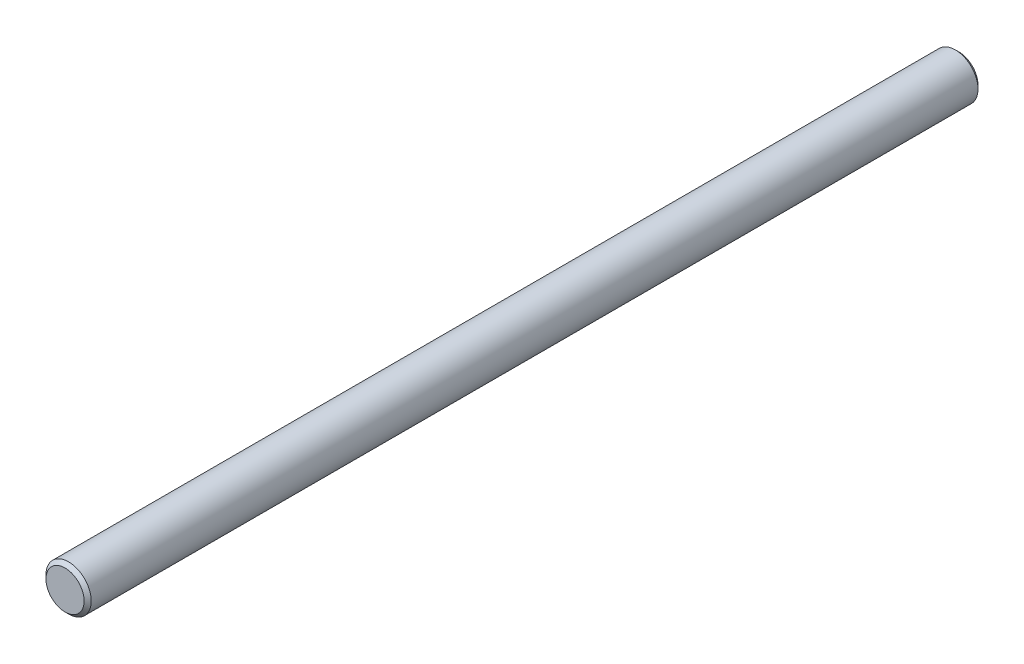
ISO-10303-21;
HEADER;
FILE_DESCRIPTION(('STEP AP214'),'2;1');
FILE_NAME('part.step','',(''),(''),'','','');
FILE_SCHEMA(('AUTOMOTIVE_DESIGN { 1 0 10303 214 1 1 1 1 }'));
ENDSEC;
DATA;
#1=APPLICATION_CONTEXT('core data for automotive mechanical design processes');
#2=APPLICATION_PROTOCOL_DEFINITION('international standard','automotive_design',2000,#1);
#3=PRODUCT_CONTEXT('',#1,'mechanical');
#4=PRODUCT('Part','Part','',(#3));
#5=PRODUCT_RELATED_PRODUCT_CATEGORY('part','',(#4));
#6=PRODUCT_DEFINITION_FORMATION('','',#4);
#7=PRODUCT_DEFINITION_CONTEXT('part definition',#1,'design');
#8=PRODUCT_DEFINITION('design','',#6,#7);
#9=PRODUCT_DEFINITION_SHAPE('','',#8);
#10=(LENGTH_UNIT() NAMED_UNIT(*) SI_UNIT(.MILLI.,.METRE.));
#11=(NAMED_UNIT(*) PLANE_ANGLE_UNIT() SI_UNIT($,.RADIAN.));
#12=(NAMED_UNIT(*) SI_UNIT($,.STERADIAN.) SOLID_ANGLE_UNIT());
#13=UNCERTAINTY_MEASURE_WITH_UNIT(LENGTH_MEASURE(1.E-05),#10,'distance_accuracy_value','');
#14=(GEOMETRIC_REPRESENTATION_CONTEXT(3) GLOBAL_UNCERTAINTY_ASSIGNED_CONTEXT((#13)) GLOBAL_UNIT_ASSIGNED_CONTEXT((#10,
#11,#12)) REPRESENTATION_CONTEXT('',''));
#15=CARTESIAN_POINT('',(0.,0.,0.));
#16=DIRECTION('',(0.,0.,1.));
#17=DIRECTION('',(1.,0.,0.));
#18=AXIS2_PLACEMENT_3D('',#15,#16,#17);
#19=CARTESIAN_POINT('',(0.,-1.38777878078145E-13,-158.));
#20=DIRECTION('',(0.,0.,1.));
#21=DIRECTION('',(0.999999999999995,0.,0.));
#22=AXIS2_PLACEMENT_3D('',#19,#20,#21);
#23=CYLINDRICAL_SURFACE('',#22,4.);
#24=CARTESIAN_POINT('',(-1.2490009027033E-13,-1.11022302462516E-13,-0.625000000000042));
#25=DIRECTION('',(0.,0.,1.));
#26=DIRECTION('',(0.999999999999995,0.,0.));
#27=AXIS2_PLACEMENT_3D('',#24,#25,#26);
#28=CIRCLE('',#27,4.);
#29=CARTESIAN_POINT('',(3.99999999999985,-1.12049963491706E-13,-0.625000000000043));
#30=VERTEX_POINT('',#29);
#31=EDGE_CURVE('E12',#30,#30,#28,.F.);
#32=ORIENTED_EDGE('',*,*,#31,.T.);
#33=EDGE_LOOP('',(#32));
#34=FACE_BOUND('',#33,.T.);
#35=CARTESIAN_POINT('',(0.,-1.66533453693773E-13,-157.375));
#36=DIRECTION('',(0.,0.,1.));
#37=DIRECTION('',(0.999999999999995,0.,0.));
#38=AXIS2_PLACEMENT_3D('',#35,#36,#37);
#39=CIRCLE('',#38,4.);
#40=CARTESIAN_POINT('',(3.99999999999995,-1.67561114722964E-13,-157.375));
#41=VERTEX_POINT('',#40);
#42=EDGE_CURVE('E50',#41,#41,#39,.T.);
#43=ORIENTED_EDGE('',*,*,#42,.T.);
#44=EDGE_LOOP('',(#43));
#45=FACE_BOUND('',#44,.T.);
#46=ADVANCED_FACE('F36',(#34,#45),#23,.T.);
#47=CARTESIAN_POINT('',(0.,-1.38777878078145E-13,-158.));
#48=DIRECTION('',(0.,0.,1.));
#49=DIRECTION('',(0.999999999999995,0.,0.));
#50=AXIS2_PLACEMENT_3D('',#47,#48,#49);
#51=PLANE('',#50);
#52=CARTESIAN_POINT('',(0.,-1.38777878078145E-13,-158.));
#53=DIRECTION('',(0.,0.,1.));
#54=DIRECTION('',(0.999999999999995,0.,0.));
#55=AXIS2_PLACEMENT_3D('',#52,#53,#54);
#56=CIRCLE('',#55,3.375);
#57=CARTESIAN_POINT('',(3.37499999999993,-1.39644967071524E-13,-158.));
#58=VERTEX_POINT('',#57);
#59=EDGE_CURVE('E46',#58,#58,#56,.F.);
#60=ORIENTED_EDGE('',*,*,#59,.T.);
#61=EDGE_LOOP('',(#60));
#62=FACE_BOUND('',#61,.T.);
#63=ADVANCED_FACE('F69',(#62),#51,.F.);
#64=CARTESIAN_POINT('',(-1.2490009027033E-13,0.,0.));
#65=DIRECTION('',(0.,0.,1.));
#66=DIRECTION('',(0.999999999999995,0.,0.));
#67=AXIS2_PLACEMENT_3D('',#64,#65,#66);
#68=PLANE('',#67);
#69=CARTESIAN_POINT('',(-1.2490009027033E-13,0.,0.));
#70=DIRECTION('',(0.,0.,1.));
#71=DIRECTION('',(0.999999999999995,0.,0.));
#72=AXIS2_PLACEMENT_3D('',#69,#70,#71);
#73=CIRCLE('',#72,3.375);
#74=CARTESIAN_POINT('',(3.37499999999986,0.,0.));
#75=VERTEX_POINT('',#74);
#76=EDGE_CURVE('E42',#75,#75,#73,.T.);
#77=ORIENTED_EDGE('',*,*,#76,.T.);
#78=EDGE_LOOP('',(#77));
#79=FACE_BOUND('',#78,.T.);
#80=ADVANCED_FACE('F60',(#79),#68,.T.);
#81=CARTESIAN_POINT('',(0.,-1.66533453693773E-13,-157.375));
#82=DIRECTION('',(0.,0.,1.));
#83=DIRECTION('',(0.999999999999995,0.,0.));
#84=AXIS2_PLACEMENT_3D('',#81,#82,#83);
#85=CONICAL_SURFACE('',#84,4.,0.785398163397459);
#86=ORIENTED_EDGE('',*,*,#59,.F.);
#87=EDGE_LOOP('',(#86));
#88=FACE_BOUND('',#87,.T.);
#89=ORIENTED_EDGE('',*,*,#42,.F.);
#90=EDGE_LOOP('',(#89));
#91=FACE_BOUND('',#90,.T.);
#92=ADVANCED_FACE('F57',(#88,#91),#85,.T.);
#93=CARTESIAN_POINT('',(-1.2490009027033E-13,0.,0.));
#94=DIRECTION('',(0.,0.,-1.));
#95=DIRECTION('',(-0.999999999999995,0.,0.));
#96=AXIS2_PLACEMENT_3D('',#93,#94,#95);
#97=CONICAL_SURFACE('',#96,3.375,0.785398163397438);
#98=ORIENTED_EDGE('',*,*,#31,.F.);
#99=EDGE_LOOP('',(#98));
#100=FACE_BOUND('',#99,.T.);
#101=ORIENTED_EDGE('',*,*,#76,.F.);
#102=EDGE_LOOP('',(#101));
#103=FACE_BOUND('',#102,.T.);
#104=ADVANCED_FACE('F59',(#100,#103),#97,.T.);
#105=CLOSED_SHELL('',(#46,#63,#80,#92,#104));
#106=MANIFOLD_SOLID_BREP('B2',#105);
#107=ADVANCED_BREP_SHAPE_REPRESENTATION('',(#18,#106),#14);
#108=SHAPE_DEFINITION_REPRESENTATION(#9,#107);
ENDSEC;
END-ISO-10303-21;
